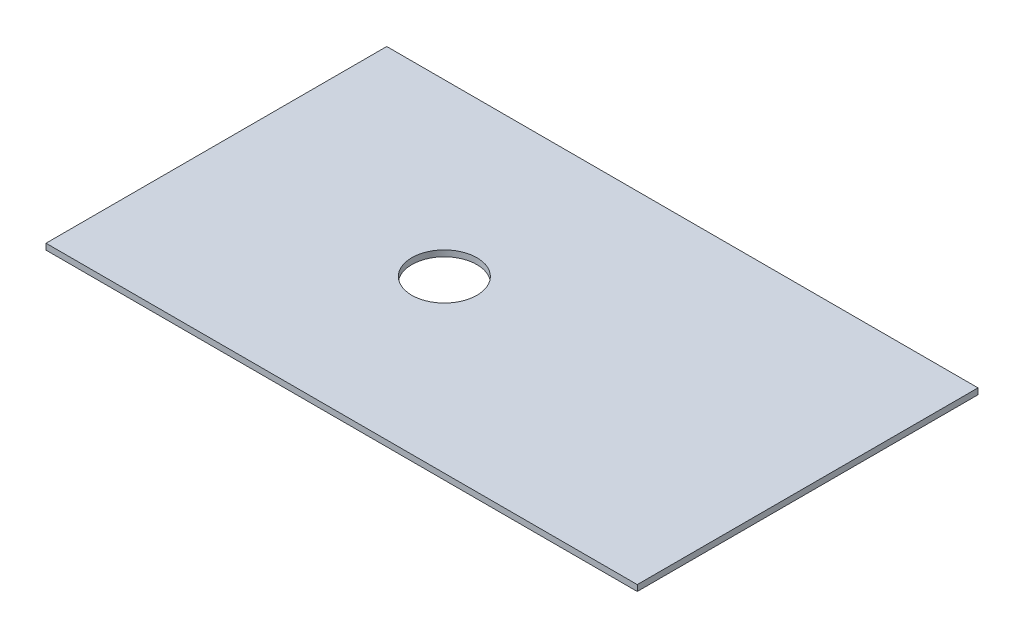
from build123d import *

# Parameters (mm, degrees)
SKETCH1_W           = 1180
SKETCH1_H           = 680
BOSS_EXTRUDE1_DEPTH = 6
CUT_EXTRUDE1_REACH  = 683.061
SKETCH2_R           = 65


with BuildPart() as part:
    # Sketch1 → Boss-Extrude1 (new, symmetric)
    with BuildSketch(Plane(origin=(0, 0, 0), x_dir=(1, 0, 0), z_dir=(0, 1, 0))):
        Rectangle(SKETCH1_W, SKETCH1_H)
    extrude(amount=BOSS_EXTRUDE1_DEPTH, both=True)

    # Sketch2 → Cut-Extrude1 (cut, up to next)
    with BuildSketch(Plane(origin=(0, 6, 0), x_dir=(1, 0, 0), z_dir=(0, 1, 0)), mode=Mode.PRIVATE) as cut_extrude1_sk1:
        with Locations(Location((-135, 0, 0), (0, 0, 270))):
            Circle(SKETCH2_R)
    cut_extrude1_tool1 = extrude(cut_extrude1_sk1.sketch, amount=-CUT_EXTRUDE1_REACH, mode=Mode.PRIVATE) & part.part
    add(cut_extrude1_tool1.solids().sort_by_distance((-135, 6, 0))[0], mode=Mode.SUBTRACT)


solid = part.part
